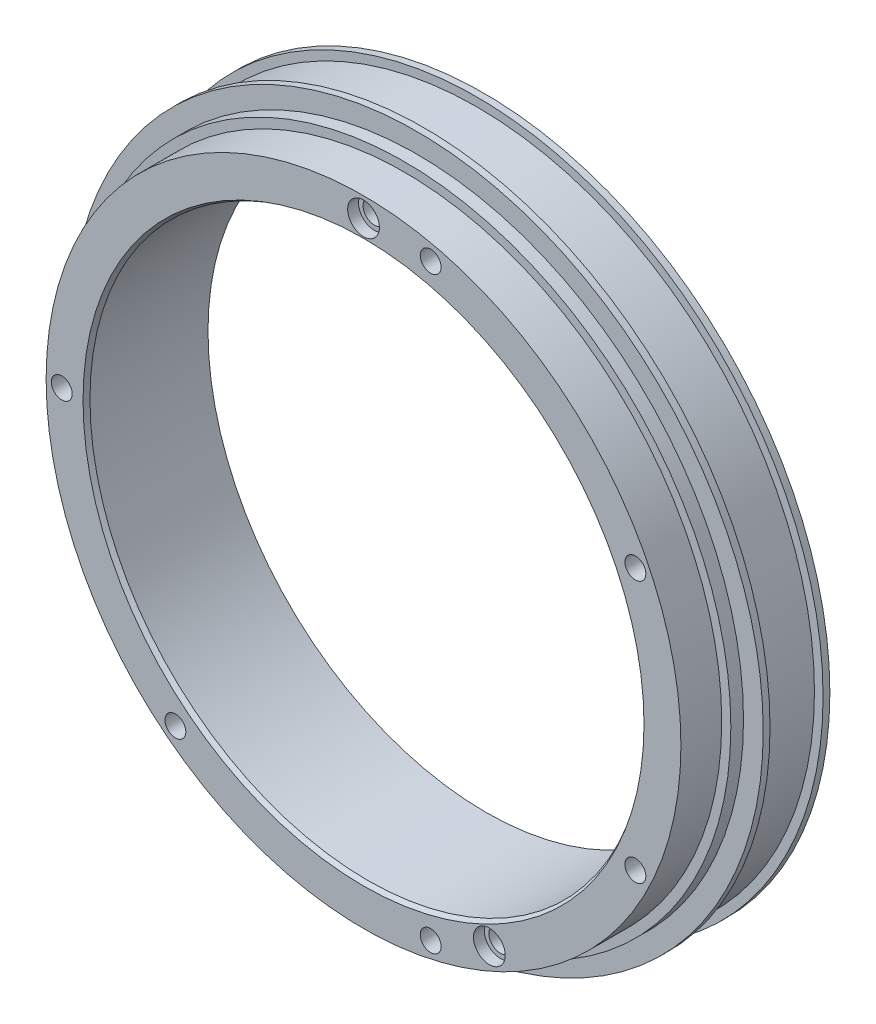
ISO-10303-21;
HEADER;
FILE_DESCRIPTION(('STEP AP214'),'2;1');
FILE_NAME('part.step','',(''),(''),'','','');
FILE_SCHEMA(('AUTOMOTIVE_DESIGN { 1 0 10303 214 1 1 1 1 }'));
ENDSEC;
DATA;
#1=APPLICATION_CONTEXT('core data for automotive mechanical design processes');
#2=APPLICATION_PROTOCOL_DEFINITION('international standard','automotive_design',2000,#1);
#3=PRODUCT_CONTEXT('',#1,'mechanical');
#4=PRODUCT('Part','Part','',(#3));
#5=PRODUCT_RELATED_PRODUCT_CATEGORY('part','',(#4));
#6=PRODUCT_DEFINITION_FORMATION('','',#4);
#7=PRODUCT_DEFINITION_CONTEXT('part definition',#1,'design');
#8=PRODUCT_DEFINITION('design','',#6,#7);
#9=PRODUCT_DEFINITION_SHAPE('','',#8);
#10=(LENGTH_UNIT() NAMED_UNIT(*) SI_UNIT(.MILLI.,.METRE.));
#11=(NAMED_UNIT(*) PLANE_ANGLE_UNIT() SI_UNIT($,.RADIAN.));
#12=(NAMED_UNIT(*) SI_UNIT($,.STERADIAN.) SOLID_ANGLE_UNIT());
#13=UNCERTAINTY_MEASURE_WITH_UNIT(LENGTH_MEASURE(1.E-05),#10,'distance_accuracy_value','');
#14=(GEOMETRIC_REPRESENTATION_CONTEXT(3) GLOBAL_UNCERTAINTY_ASSIGNED_CONTEXT((#13)) GLOBAL_UNIT_ASSIGNED_CONTEXT((#10,
#11,#12)) REPRESENTATION_CONTEXT('',''));
#15=CARTESIAN_POINT('',(0.,0.,0.));
#16=DIRECTION('',(0.,0.,1.));
#17=DIRECTION('',(1.,0.,0.));
#18=AXIS2_PLACEMENT_3D('',#15,#16,#17);
#19=CARTESIAN_POINT('',(61.3,0.,-6.858));
#20=DIRECTION('',(0.,0.,1.));
#21=DIRECTION('',(1.,0.,0.));
#22=AXIS2_PLACEMENT_3D('',#19,#20,#21);
#23=PLANE('',#22);
#24=CARTESIAN_POINT('',(27.7486924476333,-59.5072629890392,-6.858));
#25=DIRECTION('',(0.,0.,1.));
#26=DIRECTION('',(1.,0.,0.));
#27=AXIS2_PLACEMENT_3D('',#24,#25,#26);
#28=CIRCLE('',#27,3.5);
#29=CARTESIAN_POINT('',(31.2486924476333,-59.5072629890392,-6.858));
#30=VERTEX_POINT('',#29);
#31=EDGE_CURVE('E528',#30,#30,#28,.T.);
#32=ORIENTED_EDGE('',*,*,#31,.F.);
#33=EDGE_LOOP('',(#32));
#34=FACE_BOUND('',#33,.T.);
#35=CARTESIAN_POINT('',(14.8083231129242,-64.8795026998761,-6.858));
#36=DIRECTION('',(0.,0.,-1.));
#37=DIRECTION('',(-1.,0.,0.));
#38=AXIS2_PLACEMENT_3D('',#35,#36,#37);
#39=CIRCLE('',#38,2.29999999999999);
#40=CARTESIAN_POINT('',(12.5083231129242,-64.8795026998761,-6.858));
#41=VERTEX_POINT('',#40);
#42=EDGE_CURVE('E531',#41,#41,#39,.T.);
#43=ORIENTED_EDGE('',*,*,#42,.T.);
#44=EDGE_LOOP('',(#43));
#45=FACE_BOUND('',#44,.T.);
#46=CARTESIAN_POINT('',(59.9576762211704,28.8740950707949,-6.858));
#47=DIRECTION('',(0.,0.,-1.));
#48=DIRECTION('',(-1.,0.,0.));
#49=AXIS2_PLACEMENT_3D('',#46,#47,#48);
#50=CIRCLE('',#49,2.3);
#51=CARTESIAN_POINT('',(57.6576762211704,28.8740950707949,-6.858));
#52=VERTEX_POINT('',#51);
#53=EDGE_CURVE('E547',#52,#52,#50,.T.);
#54=ORIENTED_EDGE('',*,*,#53,.T.);
#55=EDGE_LOOP('',(#54));
#56=FACE_BOUND('',#55,.T.);
#57=CARTESIAN_POINT('',(-66.548,0.,-6.858));
#58=DIRECTION('',(0.,0.,-1.));
#59=DIRECTION('',(-1.,0.,0.));
#60=AXIS2_PLACEMENT_3D('',#57,#58,#59);
#61=CIRCLE('',#60,2.3);
#62=CARTESIAN_POINT('',(-68.848,0.,-6.858));
#63=VERTEX_POINT('',#62);
#64=EDGE_CURVE('E385',#63,#63,#61,.T.);
#65=ORIENTED_EDGE('',*,*,#64,.T.);
#66=EDGE_LOOP('',(#65));
#67=FACE_BOUND('',#66,.T.);
#68=CARTESIAN_POINT('',(0.,65.659,-6.858));
#69=DIRECTION('',(0.,0.,1.));
#70=DIRECTION('',(1.,0.,0.));
#71=AXIS2_PLACEMENT_3D('',#68,#69,#70);
#72=CIRCLE('',#71,3.5);
#73=CARTESIAN_POINT('',(3.49999999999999,65.659,-6.858));
#74=VERTEX_POINT('',#73);
#75=EDGE_CURVE('E409',#74,#74,#72,.T.);
#76=ORIENTED_EDGE('',*,*,#75,.F.);
#77=EDGE_LOOP('',(#76));
#78=FACE_BOUND('',#77,.T.);
#79=CARTESIAN_POINT('',(0.,0.,-6.858));
#80=DIRECTION('',(0.,0.,1.));
#81=DIRECTION('',(1.,0.,0.));
#82=AXIS2_PLACEMENT_3D('',#79,#80,#81);
#83=CIRCLE('',#82,61.86);
#84=CARTESIAN_POINT('',(61.86,0.,-6.858));
#85=VERTEX_POINT('',#84);
#86=EDGE_CURVE('E11',#85,#85,#83,.F.);
#87=ORIENTED_EDGE('',*,*,#86,.T.);
#88=EDGE_LOOP('',(#87));
#89=FACE_BOUND('',#88,.T.);
#90=CARTESIAN_POINT('',(0.,0.,-6.85800000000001));
#91=DIRECTION('',(0.,0.,1.));
#92=DIRECTION('',(1.,0.,0.));
#93=AXIS2_PLACEMENT_3D('',#90,#91,#92);
#94=CIRCLE('',#93,70.001);
#95=CARTESIAN_POINT('',(70.001,0.,-6.85800000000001));
#96=VERTEX_POINT('',#95);
#97=EDGE_CURVE('E436',#96,#96,#94,.T.);
#98=ORIENTED_EDGE('',*,*,#97,.T.);
#99=EDGE_LOOP('',(#98));
#100=FACE_BOUND('',#99,.T.);
#101=CARTESIAN_POINT('',(14.808323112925,64.879502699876,-6.858));
#102=DIRECTION('',(0.,0.,-1.));
#103=DIRECTION('',(-1.,0.,0.));
#104=AXIS2_PLACEMENT_3D('',#101,#102,#103);
#105=CIRCLE('',#104,2.29999999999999);
#106=CARTESIAN_POINT('',(12.508323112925,64.879502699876,-6.858));
#107=VERTEX_POINT('',#106);
#108=EDGE_CURVE('E518',#107,#107,#105,.T.);
#109=ORIENTED_EDGE('',*,*,#108,.T.);
#110=EDGE_LOOP('',(#109));
#111=FACE_BOUND('',#110,.T.);
#112=CARTESIAN_POINT('',(59.95767622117,-28.8740950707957,-6.858));
#113=DIRECTION('',(0.,0.,-1.));
#114=DIRECTION('',(-1.,0.,0.));
#115=AXIS2_PLACEMENT_3D('',#112,#113,#114);
#116=CIRCLE('',#115,2.3);
#117=CARTESIAN_POINT('',(57.65767622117,-28.8740950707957,-6.858));
#118=VERTEX_POINT('',#117);
#119=EDGE_CURVE('E522',#118,#118,#116,.T.);
#120=ORIENTED_EDGE('',*,*,#119,.T.);
#121=EDGE_LOOP('',(#120));
#122=FACE_BOUND('',#121,.T.);
#123=CARTESIAN_POINT('',(-41.4919993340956,-52.029321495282,-6.858));
#124=DIRECTION('',(0.,0.,-1.));
#125=DIRECTION('',(-1.,0.,0.));
#126=AXIS2_PLACEMENT_3D('',#123,#124,#125);
#127=CIRCLE('',#126,2.3);
#128=CARTESIAN_POINT('',(-43.7919993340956,-52.029321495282,-6.858));
#129=VERTEX_POINT('',#128);
#130=EDGE_CURVE('E525',#129,#129,#127,.T.);
#131=ORIENTED_EDGE('',*,*,#130,.T.);
#132=EDGE_LOOP('',(#131));
#133=FACE_BOUND('',#132,.T.);
#134=ADVANCED_FACE('F354',(#34,#45,#56,#67,#78,#89,#100,#111,#122,#133),#23,.T.);
#135=CARTESIAN_POINT('',(0.,0.,0.));
#136=DIRECTION('',(0.,0.,1.));
#137=DIRECTION('',(1.,0.,0.));
#138=AXIS2_PLACEMENT_3D('',#135,#136,#137);
#139=CYLINDRICAL_SURFACE('',#138,76.3528);
#140=CARTESIAN_POINT('',(0.,0.,-20.158));
#141=DIRECTION('',(0.,0.,1.));
#142=DIRECTION('',(1.,0.,0.));
#143=AXIS2_PLACEMENT_3D('',#140,#141,#142);
#144=CIRCLE('',#143,76.3528);
#145=CARTESIAN_POINT('',(76.3528,0.,-20.158));
#146=VERTEX_POINT('',#145);
#147=EDGE_CURVE('E412',#146,#146,#144,.T.);
#148=ORIENTED_EDGE('',*,*,#147,.T.);
#149=EDGE_LOOP('',(#148));
#150=FACE_BOUND('',#149,.T.);
#151=CARTESIAN_POINT('',(0.,0.,-18.658));
#152=DIRECTION('',(0.,0.,1.));
#153=DIRECTION('',(1.,0.,0.));
#154=AXIS2_PLACEMENT_3D('',#151,#152,#153);
#155=CIRCLE('',#154,76.3528);
#156=CARTESIAN_POINT('',(76.3528,0.,-18.658));
#157=VERTEX_POINT('',#156);
#158=EDGE_CURVE('E448',#157,#157,#155,.T.);
#159=ORIENTED_EDGE('',*,*,#158,.F.);
#160=EDGE_LOOP('',(#159));
#161=FACE_BOUND('',#160,.T.);
#162=ADVANCED_FACE('F356',(#150,#161),#139,.T.);
#163=CARTESIAN_POINT('',(76.3528,0.,-18.658));
#164=DIRECTION('',(0.,0.,1.));
#165=DIRECTION('',(1.,0.,0.));
#166=AXIS2_PLACEMENT_3D('',#163,#164,#165);
#167=PLANE('',#166);
#168=ORIENTED_EDGE('',*,*,#158,.T.);
#169=EDGE_LOOP('',(#168));
#170=FACE_BOUND('',#169,.T.);
#171=CARTESIAN_POINT('',(0.,0.,-18.658));
#172=DIRECTION('',(0.,0.,1.));
#173=DIRECTION('',(1.,0.,0.));
#174=AXIS2_PLACEMENT_3D('',#171,#172,#173);
#175=CIRCLE('',#174,72.009);
#176=CARTESIAN_POINT('',(72.009,0.,-18.658));
#177=VERTEX_POINT('',#176);
#178=EDGE_CURVE('E445',#177,#177,#175,.T.);
#179=ORIENTED_EDGE('',*,*,#178,.F.);
#180=EDGE_LOOP('',(#179));
#181=FACE_BOUND('',#180,.T.);
#182=ADVANCED_FACE('F482',(#170,#181),#167,.T.);
#183=CARTESIAN_POINT('',(0.,0.,0.));
#184=DIRECTION('',(0.,0.,1.));
#185=DIRECTION('',(1.,0.,0.));
#186=AXIS2_PLACEMENT_3D('',#183,#184,#185);
#187=CYLINDRICAL_SURFACE('',#186,72.009);
#188=ORIENTED_EDGE('',*,*,#178,.T.);
#189=EDGE_LOOP('',(#188));
#190=FACE_BOUND('',#189,.T.);
#191=CARTESIAN_POINT('',(0.,0.,-15.858));
#192=DIRECTION('',(0.,0.,1.));
#193=DIRECTION('',(1.,0.,0.));
#194=AXIS2_PLACEMENT_3D('',#191,#192,#193);
#195=CIRCLE('',#194,72.009);
#196=CARTESIAN_POINT('',(72.009,0.,-15.858));
#197=VERTEX_POINT('',#196);
#198=EDGE_CURVE('E442',#197,#197,#195,.T.);
#199=ORIENTED_EDGE('',*,*,#198,.F.);
#200=EDGE_LOOP('',(#199));
#201=FACE_BOUND('',#200,.T.);
#202=ADVANCED_FACE('F496',(#190,#201),#187,.T.);
#203=CARTESIAN_POINT('',(70.001,0.,-15.858));
#204=DIRECTION('',(0.,0.,1.));
#205=DIRECTION('',(1.,0.,0.));
#206=AXIS2_PLACEMENT_3D('',#203,#204,#205);
#207=PLANE('',#206);
#208=ORIENTED_EDGE('',*,*,#198,.T.);
#209=EDGE_LOOP('',(#208));
#210=FACE_BOUND('',#209,.T.);
#211=CARTESIAN_POINT('',(0.,0.,-15.858));
#212=DIRECTION('',(0.,0.,1.));
#213=DIRECTION('',(1.,0.,0.));
#214=AXIS2_PLACEMENT_3D('',#211,#212,#213);
#215=CIRCLE('',#214,70.001);
#216=CARTESIAN_POINT('',(70.001,0.,-15.858));
#217=VERTEX_POINT('',#216);
#218=EDGE_CURVE('E439',#217,#217,#215,.T.);
#219=ORIENTED_EDGE('',*,*,#218,.F.);
#220=EDGE_LOOP('',(#219));
#221=FACE_BOUND('',#220,.T.);
#222=ADVANCED_FACE('F492',(#210,#221),#207,.T.);
#223=CARTESIAN_POINT('',(0.,0.,0.));
#224=DIRECTION('',(0.,0.,1.));
#225=DIRECTION('',(1.,0.,0.));
#226=AXIS2_PLACEMENT_3D('',#223,#224,#225);
#227=CYLINDRICAL_SURFACE('',#226,70.001);
#228=ORIENTED_EDGE('',*,*,#218,.T.);
#229=EDGE_LOOP('',(#228));
#230=FACE_BOUND('',#229,.T.);
#231=ORIENTED_EDGE('',*,*,#97,.F.);
#232=EDGE_LOOP('',(#231));
#233=FACE_BOUND('',#232,.T.);
#234=ADVANCED_FACE('F489',(#230,#233),#227,.T.);
#235=CARTESIAN_POINT('',(0.,0.,0.));
#236=DIRECTION('',(0.,0.,1.));
#237=DIRECTION('',(1.,0.,0.));
#238=AXIS2_PLACEMENT_3D('',#235,#236,#237);
#239=CYLINDRICAL_SURFACE('',#238,61.3);
#240=CARTESIAN_POINT('',(0.,0.,-7.82794845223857));
#241=DIRECTION('',(0.,0.,1.));
#242=DIRECTION('',(1.,0.,0.));
#243=AXIS2_PLACEMENT_3D('',#240,#241,#242);
#244=CIRCLE('',#243,61.3);
#245=CARTESIAN_POINT('',(61.3,0.,-7.82794845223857));
#246=VERTEX_POINT('',#245);
#247=EDGE_CURVE('E362',#246,#246,#244,.T.);
#248=ORIENTED_EDGE('',*,*,#247,.T.);
#249=EDGE_LOOP('',(#248));
#250=FACE_BOUND('',#249,.T.);
#251=CARTESIAN_POINT('',(0.,0.,-33.858));
#252=DIRECTION('',(0.,0.,1.));
#253=DIRECTION('',(1.,0.,0.));
#254=AXIS2_PLACEMENT_3D('',#251,#252,#253);
#255=CIRCLE('',#254,61.3);
#256=CARTESIAN_POINT('',(61.3,0.,-33.858));
#257=VERTEX_POINT('',#256);
#258=EDGE_CURVE('E433',#257,#257,#255,.T.);
#259=ORIENTED_EDGE('',*,*,#258,.F.);
#260=EDGE_LOOP('',(#259));
#261=FACE_BOUND('',#260,.T.);
#262=ADVANCED_FACE('F453',(#250,#261),#239,.F.);
#263=CARTESIAN_POINT('',(72.009,0.,-33.858));
#264=DIRECTION('',(0.,0.,-1.));
#265=DIRECTION('',(-1.,0.,0.));
#266=AXIS2_PLACEMENT_3D('',#263,#264,#265);
#267=PLANE('',#266);
#268=CARTESIAN_POINT('',(-41.4919993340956,-52.029321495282,-33.858));
#269=DIRECTION('',(0.,0.,-1.));
#270=DIRECTION('',(-1.,0.,0.));
#271=AXIS2_PLACEMENT_3D('',#268,#269,#270);
#272=CIRCLE('',#271,2.29999999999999);
#273=CARTESIAN_POINT('',(-43.7919993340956,-52.029321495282,-33.858));
#274=VERTEX_POINT('',#273);
#275=EDGE_CURVE('E527',#274,#274,#272,.T.);
#276=ORIENTED_EDGE('',*,*,#275,.F.);
#277=EDGE_LOOP('',(#276));
#278=FACE_BOUND('',#277,.T.);
#279=CARTESIAN_POINT('',(14.8083231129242,-64.8795026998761,-33.858));
#280=DIRECTION('',(0.,0.,-1.));
#281=DIRECTION('',(-1.,0.,0.));
#282=AXIS2_PLACEMENT_3D('',#279,#280,#281);
#283=CIRCLE('',#282,2.29999999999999);
#284=CARTESIAN_POINT('',(12.5083231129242,-64.8795026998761,-33.858));
#285=VERTEX_POINT('',#284);
#286=EDGE_CURVE('E540',#285,#285,#283,.T.);
#287=ORIENTED_EDGE('',*,*,#286,.F.);
#288=EDGE_LOOP('',(#287));
#289=FACE_BOUND('',#288,.T.);
#290=CARTESIAN_POINT('',(59.95767622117,-28.8740950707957,-33.858));
#291=DIRECTION('',(0.,0.,-1.));
#292=DIRECTION('',(-1.,0.,0.));
#293=AXIS2_PLACEMENT_3D('',#290,#291,#292);
#294=CIRCLE('',#293,2.29999999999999);
#295=CARTESIAN_POINT('',(57.65767622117,-28.8740950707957,-33.858));
#296=VERTEX_POINT('',#295);
#297=EDGE_CURVE('E544',#296,#296,#294,.T.);
#298=ORIENTED_EDGE('',*,*,#297,.F.);
#299=EDGE_LOOP('',(#298));
#300=FACE_BOUND('',#299,.T.);
#301=CARTESIAN_POINT('',(59.9576762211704,28.8740950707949,-33.858));
#302=DIRECTION('',(0.,0.,-1.));
#303=DIRECTION('',(-1.,0.,0.));
#304=AXIS2_PLACEMENT_3D('',#301,#302,#303);
#305=CIRCLE('',#304,2.29999999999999);
#306=CARTESIAN_POINT('',(57.6576762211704,28.8740950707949,-33.858));
#307=VERTEX_POINT('',#306);
#308=EDGE_CURVE('E550',#307,#307,#305,.T.);
#309=ORIENTED_EDGE('',*,*,#308,.F.);
#310=EDGE_LOOP('',(#309));
#311=FACE_BOUND('',#310,.T.);
#312=CARTESIAN_POINT('',(14.808323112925,64.879502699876,-33.858));
#313=DIRECTION('',(0.,0.,-1.));
#314=DIRECTION('',(-1.,0.,0.));
#315=AXIS2_PLACEMENT_3D('',#312,#313,#314);
#316=CIRCLE('',#315,2.29999999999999);
#317=CARTESIAN_POINT('',(12.508323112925,64.879502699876,-33.858));
#318=VERTEX_POINT('',#317);
#319=EDGE_CURVE('E554',#318,#318,#316,.T.);
#320=ORIENTED_EDGE('',*,*,#319,.F.);
#321=EDGE_LOOP('',(#320));
#322=FACE_BOUND('',#321,.T.);
#323=CARTESIAN_POINT('',(-66.548,0.,-33.858));
#324=DIRECTION('',(0.,0.,-1.));
#325=DIRECTION('',(-1.,0.,0.));
#326=AXIS2_PLACEMENT_3D('',#323,#324,#325);
#327=CIRCLE('',#326,2.29999999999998);
#328=CARTESIAN_POINT('',(-68.848,0.,-33.858));
#329=VERTEX_POINT('',#328);
#330=EDGE_CURVE('E379',#329,#329,#327,.T.);
#331=ORIENTED_EDGE('',*,*,#330,.F.);
#332=EDGE_LOOP('',(#331));
#333=FACE_BOUND('',#332,.T.);
#334=CARTESIAN_POINT('',(-47.8462874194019,46.901308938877,-33.858));
#335=DIRECTION('',(0.,0.,-1.));
#336=DIRECTION('',(-1.,0.,0.));
#337=AXIS2_PLACEMENT_3D('',#334,#335,#336);
#338=CIRCLE('',#337,1.25);
#339=CARTESIAN_POINT('',(-49.0962874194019,46.901308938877,-33.858));
#340=VERTEX_POINT('',#339);
#341=EDGE_CURVE('E378',#340,#340,#338,.T.);
#342=ORIENTED_EDGE('',*,*,#341,.F.);
#343=EDGE_LOOP('',(#342));
#344=FACE_BOUND('',#343,.T.);
#345=CARTESIAN_POINT('',(-35.0785946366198,57.0832041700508,-33.858));
#346=DIRECTION('',(0.,0.,-1.));
#347=DIRECTION('',(-1.,0.,0.));
#348=AXIS2_PLACEMENT_3D('',#345,#346,#347);
#349=CIRCLE('',#348,1.25);
#350=CARTESIAN_POINT('',(-36.3285946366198,57.0832041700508,-33.858));
#351=VERTEX_POINT('',#350);
#352=EDGE_CURVE('E391',#351,#351,#349,.T.);
#353=ORIENTED_EDGE('',*,*,#352,.F.);
#354=EDGE_LOOP('',(#353));
#355=FACE_BOUND('',#354,.T.);
#356=CARTESIAN_POINT('',(-41.773816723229,52.3827093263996,-33.858));
#357=DIRECTION('',(0.,0.,-1.));
#358=DIRECTION('',(-1.,0.,0.));
#359=AXIS2_PLACEMENT_3D('',#356,#357,#358);
#360=CIRCLE('',#359,1.65);
#361=CARTESIAN_POINT('',(-43.423816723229,52.3827093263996,-33.858));
#362=VERTEX_POINT('',#361);
#363=EDGE_CURVE('E397',#362,#362,#360,.T.);
#364=ORIENTED_EDGE('',*,*,#363,.F.);
#365=EDGE_LOOP('',(#364));
#366=FACE_BOUND('',#365,.T.);
#367=ORIENTED_EDGE('',*,*,#258,.T.);
#368=EDGE_LOOP('',(#367));
#369=FACE_BOUND('',#368,.T.);
#370=CARTESIAN_POINT('',(0.,0.,-33.858));
#371=DIRECTION('',(0.,0.,1.));
#372=DIRECTION('',(1.,0.,0.));
#373=AXIS2_PLACEMENT_3D('',#370,#371,#372);
#374=CIRCLE('',#373,72.009);
#375=CARTESIAN_POINT('',(72.009,0.,-33.858));
#376=VERTEX_POINT('',#375);
#377=EDGE_CURVE('E430',#376,#376,#374,.T.);
#378=ORIENTED_EDGE('',*,*,#377,.F.);
#379=EDGE_LOOP('',(#378));
#380=FACE_BOUND('',#379,.T.);
#381=ADVANCED_FACE('F567',(#278,#289,#300,#311,#322,#333,#344,#355,#366,#369,#380),#267,.T.);
#382=CARTESIAN_POINT('',(0.,0.,0.));
#383=DIRECTION('',(0.,0.,1.));
#384=DIRECTION('',(1.,0.,0.));
#385=AXIS2_PLACEMENT_3D('',#382,#383,#384);
#386=CYLINDRICAL_SURFACE('',#385,72.009);
#387=ORIENTED_EDGE('',*,*,#377,.T.);
#388=EDGE_LOOP('',(#387));
#389=FACE_BOUND('',#388,.T.);
#390=CARTESIAN_POINT('',(0.,0.,-33.358));
#391=DIRECTION('',(0.,0.,1.));
#392=DIRECTION('',(1.,0.,0.));
#393=AXIS2_PLACEMENT_3D('',#390,#391,#392);
#394=CIRCLE('',#393,72.009);
#395=CARTESIAN_POINT('',(72.009,0.,-33.358));
#396=VERTEX_POINT('',#395);
#397=EDGE_CURVE('E427',#396,#396,#394,.T.);
#398=ORIENTED_EDGE('',*,*,#397,.F.);
#399=EDGE_LOOP('',(#398));
#400=FACE_BOUND('',#399,.T.);
#401=ADVANCED_FACE('F570',(#389,#400),#386,.T.);
#402=CARTESIAN_POINT('',(76.3528,0.,-33.358));
#403=DIRECTION('',(0.,0.,-1.));
#404=DIRECTION('',(-1.,0.,0.));
#405=AXIS2_PLACEMENT_3D('',#402,#403,#404);
#406=PLANE('',#405);
#407=ORIENTED_EDGE('',*,*,#397,.T.);
#408=EDGE_LOOP('',(#407));
#409=FACE_BOUND('',#408,.T.);
#410=CARTESIAN_POINT('',(0.,0.,-33.358));
#411=DIRECTION('',(0.,0.,1.));
#412=DIRECTION('',(1.,0.,0.));
#413=AXIS2_PLACEMENT_3D('',#410,#411,#412);
#414=CIRCLE('',#413,76.3528);
#415=CARTESIAN_POINT('',(76.3528,0.,-33.358));
#416=VERTEX_POINT('',#415);
#417=EDGE_CURVE('E424',#416,#416,#414,.T.);
#418=ORIENTED_EDGE('',*,*,#417,.F.);
#419=EDGE_LOOP('',(#418));
#420=FACE_BOUND('',#419,.T.);
#421=ADVANCED_FACE('F584',(#409,#420),#406,.T.);
#422=CARTESIAN_POINT('',(0.,0.,0.));
#423=DIRECTION('',(0.,0.,1.));
#424=DIRECTION('',(1.,0.,0.));
#425=AXIS2_PLACEMENT_3D('',#422,#423,#424);
#426=CYLINDRICAL_SURFACE('',#425,76.3528);
#427=ORIENTED_EDGE('',*,*,#417,.T.);
#428=EDGE_LOOP('',(#427));
#429=FACE_BOUND('',#428,.T.);
#430=CARTESIAN_POINT('',(0.,0.,-31.858));
#431=DIRECTION('',(0.,0.,1.));
#432=DIRECTION('',(1.,0.,0.));
#433=AXIS2_PLACEMENT_3D('',#430,#431,#432);
#434=CIRCLE('',#433,76.3528);
#435=CARTESIAN_POINT('',(76.3528,0.,-31.858));
#436=VERTEX_POINT('',#435);
#437=EDGE_CURVE('E421',#436,#436,#434,.T.);
#438=ORIENTED_EDGE('',*,*,#437,.F.);
#439=EDGE_LOOP('',(#438));
#440=FACE_BOUND('',#439,.T.);
#441=ADVANCED_FACE('F590',(#429,#440),#426,.T.);
#442=CARTESIAN_POINT('',(74.4528,0.,-31.858));
#443=DIRECTION('',(0.,0.,1.));
#444=DIRECTION('',(1.,0.,0.));
#445=AXIS2_PLACEMENT_3D('',#442,#443,#444);
#446=PLANE('',#445);
#447=ORIENTED_EDGE('',*,*,#437,.T.);
#448=EDGE_LOOP('',(#447));
#449=FACE_BOUND('',#448,.T.);
#450=CARTESIAN_POINT('',(0.,0.,-31.858));
#451=DIRECTION('',(0.,0.,1.));
#452=DIRECTION('',(1.,0.,0.));
#453=AXIS2_PLACEMENT_3D('',#450,#451,#452);
#454=CIRCLE('',#453,74.4528);
#455=CARTESIAN_POINT('',(74.4528,0.,-31.858));
#456=VERTEX_POINT('',#455);
#457=EDGE_CURVE('E418',#456,#456,#454,.T.);
#458=ORIENTED_EDGE('',*,*,#457,.F.);
#459=EDGE_LOOP('',(#458));
#460=FACE_BOUND('',#459,.T.);
#461=ADVANCED_FACE('F596',(#449,#460),#446,.T.);
#462=CARTESIAN_POINT('',(0.,0.,0.));
#463=DIRECTION('',(0.,0.,1.));
#464=DIRECTION('',(1.,0.,0.));
#465=AXIS2_PLACEMENT_3D('',#462,#463,#464);
#466=CYLINDRICAL_SURFACE('',#465,74.4528);
#467=ORIENTED_EDGE('',*,*,#457,.T.);
#468=EDGE_LOOP('',(#467));
#469=FACE_BOUND('',#468,.T.);
#470=CARTESIAN_POINT('',(0.,0.,-20.158));
#471=DIRECTION('',(0.,0.,1.));
#472=DIRECTION('',(1.,0.,0.));
#473=AXIS2_PLACEMENT_3D('',#470,#471,#472);
#474=CIRCLE('',#473,74.4528);
#475=CARTESIAN_POINT('',(74.4528,0.,-20.158));
#476=VERTEX_POINT('',#475);
#477=EDGE_CURVE('E415',#476,#476,#474,.T.);
#478=ORIENTED_EDGE('',*,*,#477,.F.);
#479=EDGE_LOOP('',(#478));
#480=FACE_BOUND('',#479,.T.);
#481=ADVANCED_FACE('F470',(#469,#480),#466,.T.);
#482=CARTESIAN_POINT('',(74.4528,0.,-20.158));
#483=DIRECTION('',(0.,0.,-1.));
#484=DIRECTION('',(-1.,0.,0.));
#485=AXIS2_PLACEMENT_3D('',#482,#483,#484);
#486=PLANE('',#485);
#487=ORIENTED_EDGE('',*,*,#477,.T.);
#488=EDGE_LOOP('',(#487));
#489=FACE_BOUND('',#488,.T.);
#490=ORIENTED_EDGE('',*,*,#147,.F.);
#491=EDGE_LOOP('',(#490));
#492=FACE_BOUND('',#491,.T.);
#493=ADVANCED_FACE('F459',(#489,#492),#486,.T.);
#494=CARTESIAN_POINT('',(0.,0.,-7.82794845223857));
#495=DIRECTION('',(0.,0.,1.));
#496=DIRECTION('',(1.,0.,0.));
#497=AXIS2_PLACEMENT_3D('',#494,#495,#496);
#498=CONICAL_SURFACE('',#497,61.3,0.523598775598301);
#499=ORIENTED_EDGE('',*,*,#86,.F.);
#500=EDGE_LOOP('',(#499));
#501=FACE_BOUND('',#500,.T.);
#502=ORIENTED_EDGE('',*,*,#247,.F.);
#503=EDGE_LOOP('',(#502));
#504=FACE_BOUND('',#503,.T.);
#505=ADVANCED_FACE('F456',(#501,#504),#498,.F.);
#506=CARTESIAN_POINT('',(0.,65.659,-6.858));
#507=DIRECTION('',(0.,0.,1.));
#508=DIRECTION('',(1.,0.,0.));
#509=AXIS2_PLACEMENT_3D('',#506,#507,#508);
#510=CYLINDRICAL_SURFACE('',#509,3.5);
#511=CARTESIAN_POINT('',(0.,65.659,-9.258));
#512=DIRECTION('',(0.,0.,1.));
#513=DIRECTION('',(1.,0.,0.));
#514=AXIS2_PLACEMENT_3D('',#511,#512,#513);
#515=CIRCLE('',#514,3.5);
#516=CARTESIAN_POINT('',(3.49999999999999,65.659,-9.258));
#517=VERTEX_POINT('',#516);
#518=EDGE_CURVE('E406',#517,#517,#515,.T.);
#519=ORIENTED_EDGE('',*,*,#518,.F.);
#520=EDGE_LOOP('',(#519));
#521=FACE_BOUND('',#520,.T.);
#522=ORIENTED_EDGE('',*,*,#75,.T.);
#523=EDGE_LOOP('',(#522));
#524=FACE_BOUND('',#523,.T.);
#525=ADVANCED_FACE('F458',(#521,#524),#510,.F.);
#526=CARTESIAN_POINT('',(2.49999999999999,65.659,-9.258));
#527=DIRECTION('',(0.,0.,-1.));
#528=DIRECTION('',(-1.,0.,0.));
#529=AXIS2_PLACEMENT_3D('',#526,#527,#528);
#530=PLANE('',#529);
#531=CARTESIAN_POINT('',(0.,65.659,-9.258));
#532=DIRECTION('',(0.,0.,1.));
#533=DIRECTION('',(1.,0.,0.));
#534=AXIS2_PLACEMENT_3D('',#531,#532,#533);
#535=CIRCLE('',#534,2.5);
#536=CARTESIAN_POINT('',(2.49999999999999,65.659,-9.258));
#537=VERTEX_POINT('',#536);
#538=EDGE_CURVE('E403',#537,#537,#535,.T.);
#539=ORIENTED_EDGE('',*,*,#538,.F.);
#540=EDGE_LOOP('',(#539));
#541=FACE_BOUND('',#540,.T.);
#542=ORIENTED_EDGE('',*,*,#518,.T.);
#543=EDGE_LOOP('',(#542));
#544=FACE_BOUND('',#543,.T.);
#545=ADVANCED_FACE('F466',(#541,#544),#530,.F.);
#546=CARTESIAN_POINT('',(0.,65.659,-6.858));
#547=DIRECTION('',(0.,0.,1.));
#548=DIRECTION('',(1.,0.,0.));
#549=AXIS2_PLACEMENT_3D('',#546,#547,#548);
#550=CYLINDRICAL_SURFACE('',#549,2.5);
#551=CARTESIAN_POINT('',(0.,65.659,-16.858));
#552=DIRECTION('',(0.,0.,1.));
#553=DIRECTION('',(1.,0.,0.));
#554=AXIS2_PLACEMENT_3D('',#551,#552,#553);
#555=CIRCLE('',#554,2.5);
#556=CARTESIAN_POINT('',(2.49999999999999,65.659,-16.858));
#557=VERTEX_POINT('',#556);
#558=EDGE_CURVE('E400',#557,#557,#555,.T.);
#559=ORIENTED_EDGE('',*,*,#558,.F.);
#560=EDGE_LOOP('',(#559));
#561=FACE_BOUND('',#560,.T.);
#562=ORIENTED_EDGE('',*,*,#538,.T.);
#563=EDGE_LOOP('',(#562));
#564=FACE_BOUND('',#563,.T.);
#565=ADVANCED_FACE('F754',(#561,#564),#550,.F.);
#566=CARTESIAN_POINT('',(0.,65.659,-16.858));
#567=DIRECTION('',(0.,0.,-1.));
#568=DIRECTION('',(-1.,0.,0.));
#569=AXIS2_PLACEMENT_3D('',#566,#567,#568);
#570=PLANE('',#569);
#571=ORIENTED_EDGE('',*,*,#558,.T.);
#572=EDGE_LOOP('',(#571));
#573=FACE_BOUND('',#572,.T.);
#574=ADVANCED_FACE('F750',(#573),#570,.F.);
#575=CARTESIAN_POINT('',(-41.773816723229,52.3827093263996,-33.858));
#576=DIRECTION('',(0.,0.,-1.));
#577=DIRECTION('',(-1.,0.,0.));
#578=AXIS2_PLACEMENT_3D('',#575,#576,#577);
#579=CYLINDRICAL_SURFACE('',#578,1.65);
#580=CARTESIAN_POINT('',(-41.773816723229,52.3827093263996,-23.758));
#581=DIRECTION('',(0.,0.,-1.));
#582=DIRECTION('',(-1.,0.,0.));
#583=AXIS2_PLACEMENT_3D('',#580,#581,#582);
#584=CIRCLE('',#583,1.65);
#585=CARTESIAN_POINT('',(-43.423816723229,52.3827093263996,-23.758));
#586=VERTEX_POINT('',#585);
#587=EDGE_CURVE('E394',#586,#586,#584,.T.);
#588=ORIENTED_EDGE('',*,*,#587,.F.);
#589=EDGE_LOOP('',(#588));
#590=FACE_BOUND('',#589,.T.);
#591=ORIENTED_EDGE('',*,*,#363,.T.);
#592=EDGE_LOOP('',(#591));
#593=FACE_BOUND('',#592,.T.);
#594=ADVANCED_FACE('F746',(#590,#593),#579,.F.);
#595=CARTESIAN_POINT('',(-41.773816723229,52.3827093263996,-23.758));
#596=DIRECTION('',(0.,0.,1.));
#597=DIRECTION('',(1.,0.,0.));
#598=AXIS2_PLACEMENT_3D('',#595,#596,#597);
#599=PLANE('',#598);
#600=ORIENTED_EDGE('',*,*,#587,.T.);
#601=EDGE_LOOP('',(#600));
#602=FACE_BOUND('',#601,.T.);
#603=ADVANCED_FACE('F742',(#602),#599,.F.);
#604=CARTESIAN_POINT('',(-35.0785946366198,57.0832041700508,-33.858));
#605=DIRECTION('',(0.,0.,-1.));
#606=DIRECTION('',(-1.,0.,0.));
#607=AXIS2_PLACEMENT_3D('',#604,#605,#606);
#608=CYLINDRICAL_SURFACE('',#607,1.25);
#609=CARTESIAN_POINT('',(-35.0785946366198,57.0832041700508,-26.858));
#610=DIRECTION('',(0.,0.,-1.));
#611=DIRECTION('',(-1.,0.,0.));
#612=AXIS2_PLACEMENT_3D('',#609,#610,#611);
#613=CIRCLE('',#612,1.25);
#614=CARTESIAN_POINT('',(-36.3285946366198,57.0832041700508,-26.858));
#615=VERTEX_POINT('',#614);
#616=EDGE_CURVE('E382',#615,#615,#613,.T.);
#617=ORIENTED_EDGE('',*,*,#616,.F.);
#618=EDGE_LOOP('',(#617));
#619=FACE_BOUND('',#618,.T.);
#620=ORIENTED_EDGE('',*,*,#352,.T.);
#621=EDGE_LOOP('',(#620));
#622=FACE_BOUND('',#621,.T.);
#623=ADVANCED_FACE('F739',(#619,#622),#608,.F.);
#624=CARTESIAN_POINT('',(-35.0785946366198,57.0832041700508,-26.858));
#625=DIRECTION('',(0.,0.,-1.));
#626=DIRECTION('',(-1.,0.,0.));
#627=AXIS2_PLACEMENT_3D('',#624,#625,#626);
#628=CONICAL_SURFACE('',#627,1.25,1.02974425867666);
#629=CARTESIAN_POINT('',(-35.0785946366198,57.0832041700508,-26.1069242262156));
#630=VERTEX_POINT('',#629);
#631=VERTEX_LOOP('',#630);
#632=FACE_BOUND('',#631,.T.);
#633=ORIENTED_EDGE('',*,*,#616,.T.);
#634=EDGE_LOOP('',(#633));
#635=FACE_BOUND('',#634,.T.);
#636=ADVANCED_FACE('F736',(#632,#635),#628,.F.);
#637=CARTESIAN_POINT('',(-47.8462874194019,46.901308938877,-33.858));
#638=DIRECTION('',(0.,0.,-1.));
#639=DIRECTION('',(-1.,0.,0.));
#640=AXIS2_PLACEMENT_3D('',#637,#638,#639);
#641=CYLINDRICAL_SURFACE('',#640,1.25);
#642=CARTESIAN_POINT('',(-47.8462874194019,46.901308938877,-26.858));
#643=DIRECTION('',(0.,0.,-1.));
#644=DIRECTION('',(-1.,0.,0.));
#645=AXIS2_PLACEMENT_3D('',#642,#643,#644);
#646=CIRCLE('',#645,1.25);
#647=CARTESIAN_POINT('',(-49.0962874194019,46.901308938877,-26.858));
#648=VERTEX_POINT('',#647);
#649=EDGE_CURVE('E376',#648,#648,#646,.T.);
#650=ORIENTED_EDGE('',*,*,#649,.F.);
#651=EDGE_LOOP('',(#650));
#652=FACE_BOUND('',#651,.T.);
#653=ORIENTED_EDGE('',*,*,#341,.T.);
#654=EDGE_LOOP('',(#653));
#655=FACE_BOUND('',#654,.T.);
#656=ADVANCED_FACE('F372',(#652,#655),#641,.F.);
#657=CARTESIAN_POINT('',(-47.8462874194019,46.901308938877,-26.858));
#658=DIRECTION('',(0.,0.,-1.));
#659=DIRECTION('',(-1.,0.,0.));
#660=AXIS2_PLACEMENT_3D('',#657,#658,#659);
#661=CONICAL_SURFACE('',#660,1.25,1.02974425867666);
#662=CARTESIAN_POINT('',(-47.8462874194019,46.901308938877,-26.1069242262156));
#663=VERTEX_POINT('',#662);
#664=VERTEX_LOOP('',#663);
#665=FACE_BOUND('',#664,.T.);
#666=ORIENTED_EDGE('',*,*,#649,.T.);
#667=EDGE_LOOP('',(#666));
#668=FACE_BOUND('',#667,.T.);
#669=ADVANCED_FACE('F368',(#665,#668),#661,.F.);
#670=CARTESIAN_POINT('',(-66.548,0.,-33.858));
#671=DIRECTION('',(0.,0.,-1.));
#672=DIRECTION('',(-1.,0.,0.));
#673=AXIS2_PLACEMENT_3D('',#670,#671,#672);
#674=CYLINDRICAL_SURFACE('',#673,2.29999999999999);
#675=ORIENTED_EDGE('',*,*,#64,.F.);
#676=EDGE_LOOP('',(#675));
#677=FACE_BOUND('',#676,.T.);
#678=ORIENTED_EDGE('',*,*,#330,.T.);
#679=EDGE_LOOP('',(#678));
#680=FACE_BOUND('',#679,.T.);
#681=ADVANCED_FACE('F371',(#677,#680),#674,.F.);
#682=CARTESIAN_POINT('',(14.808323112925,64.879502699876,-33.858));
#683=DIRECTION('',(0.,0.,-1.));
#684=DIRECTION('',(-1.,0.,0.));
#685=AXIS2_PLACEMENT_3D('',#682,#683,#684);
#686=CYLINDRICAL_SURFACE('',#685,2.29999999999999);
#687=ORIENTED_EDGE('',*,*,#108,.F.);
#688=EDGE_LOOP('',(#687));
#689=FACE_BOUND('',#688,.T.);
#690=ORIENTED_EDGE('',*,*,#319,.T.);
#691=EDGE_LOOP('',(#690));
#692=FACE_BOUND('',#691,.T.);
#693=ADVANCED_FACE('F563',(#689,#692),#686,.F.);
#694=CARTESIAN_POINT('',(59.9576762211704,28.8740950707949,-33.858));
#695=DIRECTION('',(0.,0.,-1.));
#696=DIRECTION('',(-1.,0.,0.));
#697=AXIS2_PLACEMENT_3D('',#694,#695,#696);
#698=CYLINDRICAL_SURFACE('',#697,2.29999999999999);
#699=ORIENTED_EDGE('',*,*,#53,.F.);
#700=EDGE_LOOP('',(#699));
#701=FACE_BOUND('',#700,.T.);
#702=ORIENTED_EDGE('',*,*,#308,.T.);
#703=EDGE_LOOP('',(#702));
#704=FACE_BOUND('',#703,.T.);
#705=ADVANCED_FACE('F668',(#701,#704),#698,.F.);
#706=CARTESIAN_POINT('',(59.95767622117,-28.8740950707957,-33.858));
#707=DIRECTION('',(0.,0.,-1.));
#708=DIRECTION('',(-1.,0.,0.));
#709=AXIS2_PLACEMENT_3D('',#706,#707,#708);
#710=CYLINDRICAL_SURFACE('',#709,2.29999999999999);
#711=ORIENTED_EDGE('',*,*,#119,.F.);
#712=EDGE_LOOP('',(#711));
#713=FACE_BOUND('',#712,.T.);
#714=ORIENTED_EDGE('',*,*,#297,.T.);
#715=EDGE_LOOP('',(#714));
#716=FACE_BOUND('',#715,.T.);
#717=ADVANCED_FACE('F676',(#713,#716),#710,.F.);
#718=CARTESIAN_POINT('',(14.8083231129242,-64.8795026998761,-33.858));
#719=DIRECTION('',(0.,0.,-1.));
#720=DIRECTION('',(-1.,0.,0.));
#721=AXIS2_PLACEMENT_3D('',#718,#719,#720);
#722=CYLINDRICAL_SURFACE('',#721,2.29999999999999);
#723=ORIENTED_EDGE('',*,*,#42,.F.);
#724=EDGE_LOOP('',(#723));
#725=FACE_BOUND('',#724,.T.);
#726=ORIENTED_EDGE('',*,*,#286,.T.);
#727=EDGE_LOOP('',(#726));
#728=FACE_BOUND('',#727,.T.);
#729=ADVANCED_FACE('F684',(#725,#728),#722,.F.);
#730=CARTESIAN_POINT('',(-41.4919993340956,-52.029321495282,-33.858));
#731=DIRECTION('',(0.,0.,-1.));
#732=DIRECTION('',(-1.,0.,0.));
#733=AXIS2_PLACEMENT_3D('',#730,#731,#732);
#734=CYLINDRICAL_SURFACE('',#733,2.29999999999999);
#735=ORIENTED_EDGE('',*,*,#130,.F.);
#736=EDGE_LOOP('',(#735));
#737=FACE_BOUND('',#736,.T.);
#738=ORIENTED_EDGE('',*,*,#275,.T.);
#739=EDGE_LOOP('',(#738));
#740=FACE_BOUND('',#739,.T.);
#741=ADVANCED_FACE('F691',(#737,#740),#734,.F.);
#742=CARTESIAN_POINT('',(27.7486924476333,-59.5072629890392,-6.858));
#743=DIRECTION('',(0.,0.,1.));
#744=DIRECTION('',(1.,0.,0.));
#745=AXIS2_PLACEMENT_3D('',#742,#743,#744);
#746=CYLINDRICAL_SURFACE('',#745,3.5);
#747=CARTESIAN_POINT('',(27.7486924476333,-59.5072629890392,-9.258));
#748=DIRECTION('',(0.,0.,1.));
#749=DIRECTION('',(1.,0.,0.));
#750=AXIS2_PLACEMENT_3D('',#747,#748,#749);
#751=CIRCLE('',#750,3.5);
#752=CARTESIAN_POINT('',(31.2486924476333,-59.5072629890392,-9.258));
#753=VERTEX_POINT('',#752);
#754=EDGE_CURVE('E534',#753,#753,#751,.T.);
#755=ORIENTED_EDGE('',*,*,#754,.F.);
#756=EDGE_LOOP('',(#755));
#757=FACE_BOUND('',#756,.T.);
#758=ORIENTED_EDGE('',*,*,#31,.T.);
#759=EDGE_LOOP('',(#758));
#760=FACE_BOUND('',#759,.T.);
#761=ADVANCED_FACE('F698',(#757,#760),#746,.F.);
#762=CARTESIAN_POINT('',(30.2486924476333,-59.5072629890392,-9.258));
#763=DIRECTION('',(0.,0.,-1.));
#764=DIRECTION('',(-1.,0.,0.));
#765=AXIS2_PLACEMENT_3D('',#762,#763,#764);
#766=PLANE('',#765);
#767=CARTESIAN_POINT('',(27.7486924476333,-59.5072629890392,-9.258));
#768=DIRECTION('',(0.,0.,1.));
#769=DIRECTION('',(1.,0.,0.));
#770=AXIS2_PLACEMENT_3D('',#767,#768,#769);
#771=CIRCLE('',#770,2.5);
#772=CARTESIAN_POINT('',(30.2486924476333,-59.5072629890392,-9.258));
#773=VERTEX_POINT('',#772);
#774=EDGE_CURVE('E825',#773,#773,#771,.T.);
#775=ORIENTED_EDGE('',*,*,#774,.F.);
#776=EDGE_LOOP('',(#775));
#777=FACE_BOUND('',#776,.T.);
#778=ORIENTED_EDGE('',*,*,#754,.T.);
#779=EDGE_LOOP('',(#778));
#780=FACE_BOUND('',#779,.T.);
#781=ADVANCED_FACE('F706',(#777,#780),#766,.F.);
#782=CARTESIAN_POINT('',(27.7486924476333,-59.5072629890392,-6.858));
#783=DIRECTION('',(0.,0.,1.));
#784=DIRECTION('',(1.,0.,0.));
#785=AXIS2_PLACEMENT_3D('',#782,#783,#784);
#786=CYLINDRICAL_SURFACE('',#785,2.5);
#787=CARTESIAN_POINT('',(27.7486924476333,-59.5072629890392,-16.858));
#788=DIRECTION('',(0.,0.,1.));
#789=DIRECTION('',(1.,0.,0.));
#790=AXIS2_PLACEMENT_3D('',#787,#788,#789);
#791=CIRCLE('',#790,2.5);
#792=CARTESIAN_POINT('',(30.2486924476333,-59.5072629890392,-16.858));
#793=VERTEX_POINT('',#792);
#794=EDGE_CURVE('E824',#793,#793,#791,.T.);
#795=ORIENTED_EDGE('',*,*,#794,.F.);
#796=EDGE_LOOP('',(#795));
#797=FACE_BOUND('',#796,.T.);
#798=ORIENTED_EDGE('',*,*,#774,.T.);
#799=EDGE_LOOP('',(#798));
#800=FACE_BOUND('',#799,.T.);
#801=ADVANCED_FACE('F714',(#797,#800),#786,.F.);
#802=CARTESIAN_POINT('',(27.7486924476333,-59.5072629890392,-16.858));
#803=DIRECTION('',(0.,0.,-1.));
#804=DIRECTION('',(-1.,0.,0.));
#805=AXIS2_PLACEMENT_3D('',#802,#803,#804);
#806=PLANE('',#805);
#807=ORIENTED_EDGE('',*,*,#794,.T.);
#808=EDGE_LOOP('',(#807));
#809=FACE_BOUND('',#808,.T.);
#810=ADVANCED_FACE('F722',(#809),#806,.F.);
#811=CLOSED_SHELL('',(#134,#162,#182,#202,#222,#234,#262,#381,#401,#421,#441,#461,#481,#493,
#505,#525,#545,#565,#574,#594,#603,#623,#636,#656,#669,#681,#693,#705,#717,#729,#741,#761,#781,
#801,#810));
#812=MANIFOLD_SOLID_BREP('B2',#811);
#813=ADVANCED_BREP_SHAPE_REPRESENTATION('',(#18,#812),#14);
#814=SHAPE_DEFINITION_REPRESENTATION(#9,#813);
ENDSEC;
END-ISO-10303-21;
